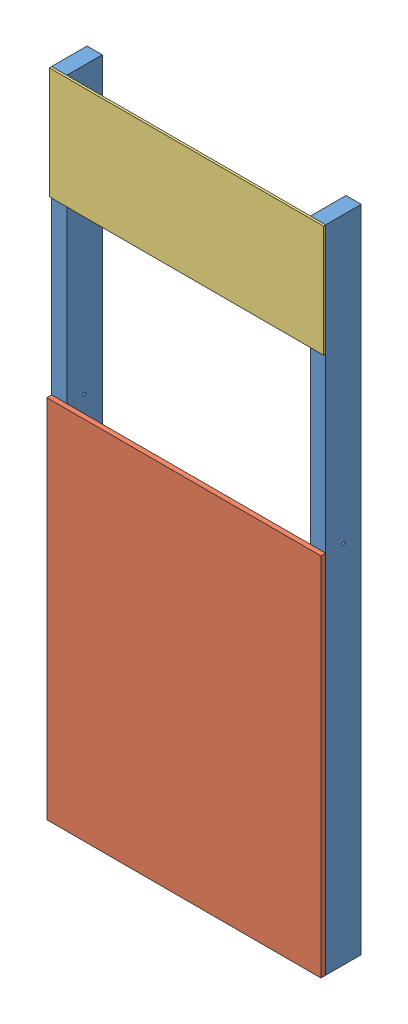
SolidWorks assembly TE-25004.SLDASM, configuration Default (file format 15000). Lengths in mm.
Overall size (685.8 1625.6 100.81).
4 component instances, 3 part files, 9 mates.
Components (placement in the parent):
- TE-25005-1: TE-25005.SLDPRT [Default] at (968.0768 913.1961 294.4053) x (0 -1 0) z (-1 0 0) size (1625.6 88.9 38.1)
- TE-25005-2: TE-25005.SLDPRT [Default] at (320.3768 913.1961 294.4053) x (0 -1 0) z (-1 0 0) size (1625.6 88.9 38.1)
- TE-25006-1: TE-25006.SLDPRT [Default] at (644.2268 -255.2039 350.7615) x (1 0 0) z (0 1 0) size (685.8 11.91 914.4)
- TE-25013-1: TE-25013.SLDPRT [Default] at (644.2268 773.4961 338.8553) x (1 0 0) z (0 -1 0) size (685.8 5.56 279.4)
Mates (geometry in assembly coordinates):
- Coincident40: coincident aligned: plane of TE-25005-1 through (968.0768 -712.4039 294.4053) normal (0 -1 0); plane of TE-25006-1 through (301.3268 -712.4039 338.8553) normal (0 -1 0)
- Coincident39: coincident anti-aligned: plane of TE-25005-2 through (301.3268 -712.4039 338.8553) normal (0 0 1); plane of TE-25006-1 through (644.2268 -255.2039 338.8553) normal (0 0 -1)
- Coincident42: coincident aligned: plane of TE-25005-2 through (301.3268 -712.4039 249.9553) normal (-1 0 0); plane of TE-25006-1 through (301.3268 201.9961 338.8553) normal (-1 0 0)
- Coincident43: coincident aligned: plane of TE-25005-2 through (320.3768 -712.4039 294.4053) normal (0 -1 0); plane of TE-25006-1 through (301.3268 -712.4039 338.8553) normal (0 -1 0)
- Coincident44: coincident anti-aligned: plane of TE-25005-1 through (949.0268 -712.4039 338.8553) normal (0 0 1); plane of TE-25006-1 through (644.2268 -255.2039 338.8553) normal (0 0 -1)
- Coincident45: coincident aligned: plane of TE-25005-1 through (987.1268 -712.4039 249.9553) normal (1 0 0); plane of TE-25006-1 through (987.1268 201.9961 338.8553) normal (1 0 0)
- Coincident46: coincident: plane of TE-25005-1 through (949.0268 -712.4039 338.8553) normal (0 0 1); plane of TE-25013-1 through (644.2268 773.4961 338.8553) normal (0 0 -1)
- Coincident47: coincident: plane of TE-25005-1 through (987.1268 -712.4039 249.9553) normal (1 0 0); plane of TE-25013-1 through (987.1268 633.7961 344.4115) normal (1 0 0)
- Coincident48: coincident aligned: plane of TE-25005-1 through (968.0768 913.1961 294.4053) normal (0 1 0); plane of TE-25013-1 through (301.3268 913.1961 344.4115) normal (0 1 0)
